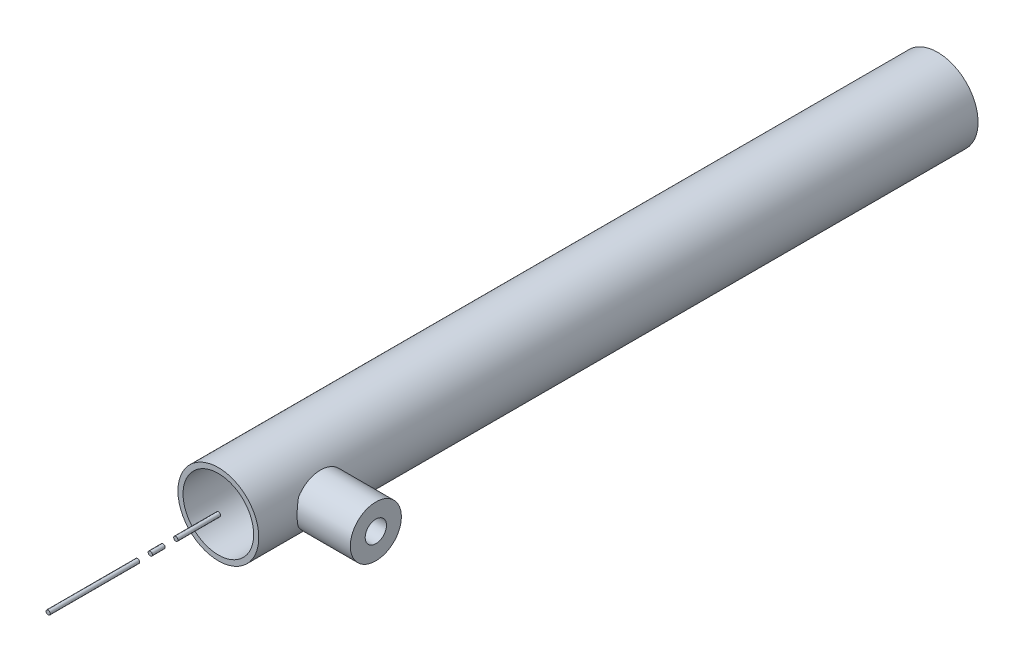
from build123d import *

# Parameters (mm, degrees)
ESQUISSE1_W                       = 9.5
ESQUISSE1_H                       = 169
ESQUISSE2_W                       = 13
ESQUISSE2_H                       = 6
D_GAGEMENT_M141_D                 = 16.6
DIAM_TRE_DU_PER_AGE_5_0_5_1_D     = 5
DIAM_TRE_DU_PER_AGE_5_0_5_1_DEPTH = 13
ESQUISSE7_R                       = 0.5
BOSS_EXTRU_1_DEPTH                = 40
ESQUISSE8_W                       = 5.397953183
ESQUISSE8_H                       = 3
ENL_V_MAT_EXTRU_1_DEPTH           = 5


with BuildPart() as part:
    # Esquisse1 → R_volution1 (revolve)
    with BuildSketch(Plane.XZ, mode=Mode.PRIVATE) as r_volution1_sk:
        with Locations((4.75, 84.5)):
            Rectangle(ESQUISSE1_W, ESQUISSE1_H)
    revolve(r_volution1_sk.sketch.rotate(Axis((0, 0, 169), (0, 0, -1)), 180), axis=Axis((0, 0, 169), (0, 0, -1)))

    # Esquisse2 → R_volution2 (revolve)
    with BuildSketch(Plane(origin=(0, -67.290069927, 39.569444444), x_dir=(-1, 0, 0), z_dir=(0, 0.8620067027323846, -0.5068968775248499)), mode=Mode.PRIVATE) as r_volution2_sk:
        with Locations((-15.5, 129.749032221)):
            Rectangle(ESQUISSE2_W, ESQUISSE2_H)
    revolve(r_volution2_sk.sketch.rotate(Axis((9, 0, 154), (1, 0, 0)), 30.45735247), axis=Axis((9, 0, 154), (1, 0, 0)))

    # D_gagement M141 (through all)
    with Locations(Plane.XY.offset(169)):
        with Locations((0, 0)):
            Hole(D_GAGEMENT_M141_D / 2)

    # Diam_tre du per_age _5.0 _5_1
    with Locations(Plane(origin=(22, 0, 0), x_dir=(0, 0, -1), z_dir=(1, 0, 0))):
        with Locations((-154, 0)):
            Hole(DIAM_TRE_DU_PER_AGE_5_0_5_1_D / 2, depth=DIAM_TRE_DU_PER_AGE_5_0_5_1_DEPTH)


with BuildPart() as body_2:
    # Esquisse7 → Boss.-Extru.1 (new body)
    with BuildSketch(Plane.XY.offset(169)):
        Circle(ESQUISSE7_R)
    extrude(amount=BOSS_EXTRU_1_DEPTH)

    # Esquisse8 → Enl_v. mat.-Extru.1 (cut)
    with BuildSketch(Plane(origin=(0, 0.5, 0), x_dir=(1, 0, 0), z_dir=(0, 1, 0))):
        with Locations((-0.051276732, -180.5)):
            Rectangle(ESQUISSE8_W, ESQUISSE8_H)
        with Locations((-0.051276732, -186.5)):
            Rectangle(ESQUISSE8_W, ESQUISSE8_H)
        with Locations((-0.051276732, -210.5)):
            Rectangle(ESQUISSE8_W, ESQUISSE8_H)
        with Locations((-0.051276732, -216.5)):
            Rectangle(ESQUISSE8_W, ESQUISSE8_H)
    extrude(amount=-ENL_V_MAT_EXTRU_1_DEPTH, mode=Mode.SUBTRACT)


with BuildPart() as enl_v_mat_extru_1_piece_1:
    # of the separate pieces the step leaves, piece 1, a body of its own (enl_v_mat_extru_1_pieces)
    add(body_2.part.solids().sort_by_distance((0.5, 0, 188))[0])


with BuildPart() as enl_v_mat_extru_1_piece_2:
    # of the separate pieces the step leaves, piece 2, a body of its own (enl_v_mat_extru_1_pieces)
    add(body_2.part.solids().sort_by_distance((0.5, 0, 169))[0])


with BuildPart() as enl_v_mat_extru_1_piece_3:
    # of the separate pieces the step leaves, piece 3, a body of its own (enl_v_mat_extru_1_pieces)
    add(body_2.part.solids().sort_by_distance((0.5, 0, 182))[0])


solid = Compound([part.part, enl_v_mat_extru_1_piece_1.part, enl_v_mat_extru_1_piece_2.part, enl_v_mat_extru_1_piece_3.part])
